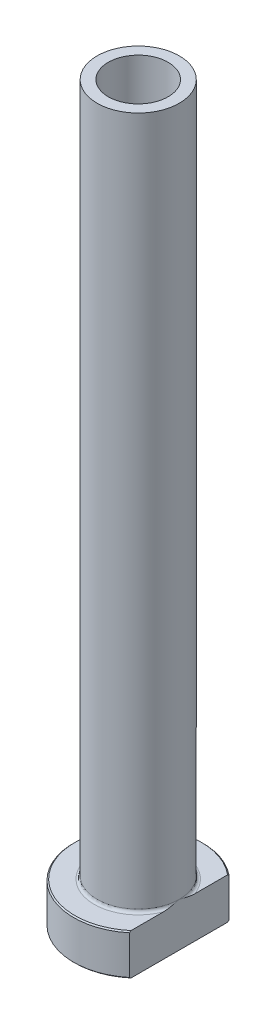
from build123d import *

# Parameters (mm, degrees)
FILLET1_R          = 0.5
CHAMFER1_SIZE      = 0.2
CUT_EXTRUDE1_DEPTH = 126.964280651
CHAMFER2_SIZE      = 0.5


with BuildPart() as part:
    # Sketch1 → Revolve1 (revolve)
    with BuildSketch(Plane.XY, mode=Mode.PRIVATE) as revolve1_sk:
        Polygon((-5.1, 125), (-7, 125), (-7, 7), (-11, 7), (-11, 0), (-5.35, 0), (-5.35, 58), (-5.1, 70), align=None)
    revolve(revolve1_sk.sketch.rotate(Axis((0, 92.187680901, 0), (0, -1, 0)), 270), axis=Axis((0, 92.187680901, 0), (0, -1, 0)))

    # Fillet1
    fillet1_edges = [part.edges().sort_by_distance(p)[0] for p in [
        (0, 7, -7),
    ]]
    fillet(fillet1_edges, radius=FILLET1_R)

    # Chamfer1
    chamfer1_edges = [part.edges().sort_by_distance(p)[0] for p in [
        (0, 0, -11),
        (0, 7, -11),
    ]]
    chamfer(chamfer1_edges, length=CHAMFER1_SIZE)

    # Sketch2 → Cut-Extrude1 (cut, through all)
    with BuildSketch(Plane.XZ):
        with BuildLine():
            Line((7, 8.485281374), (7, -8.485281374))
            ThreePointArc((7, -8.485281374), (11, 0), (7, 8.485281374))
        make_face()
    extrude(amount=-CUT_EXTRUDE1_DEPTH, mode=Mode.SUBTRACT)

    # Chamfer2
    chamfer2_edges = [part.edges().sort_by_distance(p)[0] for p in [
        (0, 0, -5.35),
    ]]
    chamfer(chamfer2_edges, length=CHAMFER2_SIZE)


solid = part.part
